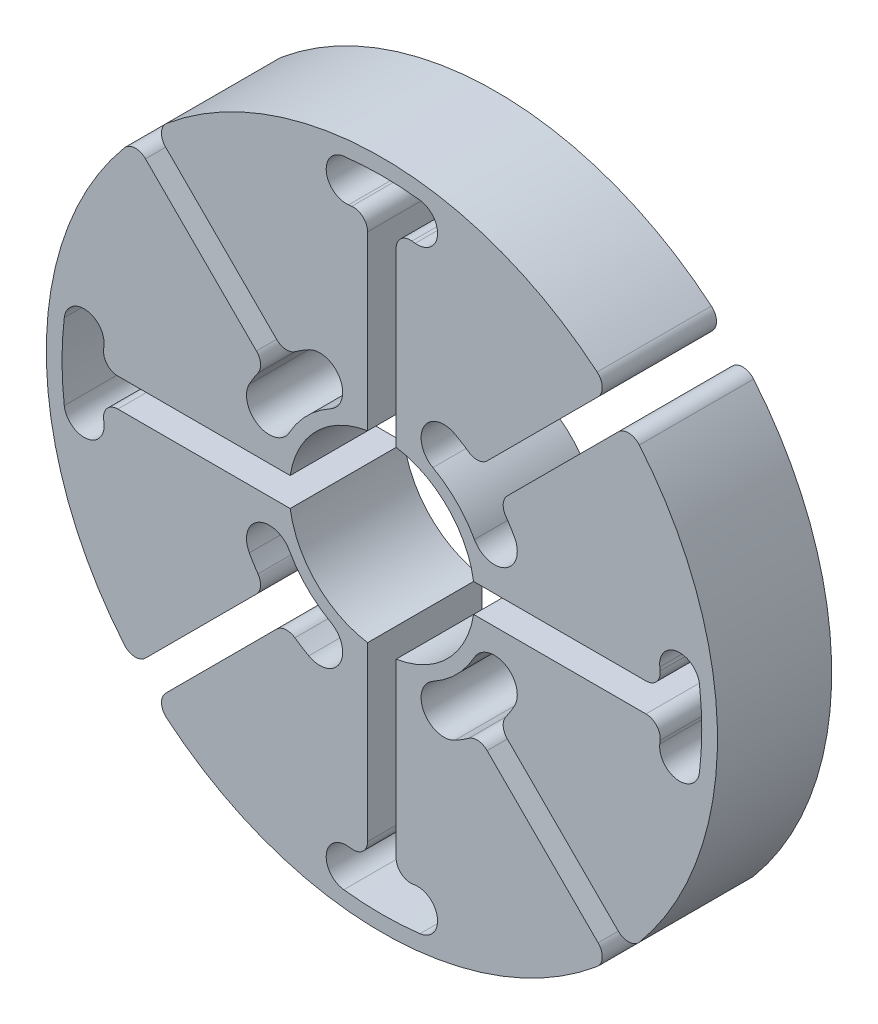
from build123d import *

# Parameters (mm, degrees)
SKETCH1_R                = 29.845
SKETCH1_R_2              = 8.255
BOSS_EXTRUDE1_DEPTH      = 5.08
CUT_EXTRUDE1_DEPTH       = 44.412828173
CUT_EXTRUDE2_DEPTH       = 44.412828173
FILLET1_R                = 1.27
CIRPATTERN1_COUNT        = 4
FILLET1_OF_CIRPATTERN1_R = 1.27


with BuildPart() as part:
    # Sketch1 → Boss-Extrude1 (new, symmetric)
    with BuildSketch(Plane.XY):
        Circle(SKETCH1_R)
        Circle(SKETCH1_R_2, mode=Mode.SUBTRACT)
    extrude(amount=BOSS_EXTRUDE1_DEPTH, both=True)

    # Sketch2 → Cut-Extrude1 (cut, through all)
    with BuildSketch(Plane.XY.offset(5.08)):
        with BuildLine():
            ThreePointArc((1.27, 24.85958093), (0, 24.892), (-1.27, 24.85958093))
            Line((-1.27, 24.85958093), (-1.27, 8.156722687))
            ThreePointArc((-1.27, 8.156722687), (0, 8.255), (1.27, 8.156722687))
            Line((1.27, 8.156722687), (1.27, 24.85958093))
        make_face()
        with BuildLine():
            ThreePointArc((3.386666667, 28.245693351), (0, 28.448), (-3.386666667, 28.245693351))
            ThreePointArc((-3.386666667, 28.245693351), (-4.940355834, 26.26867085), (-2.963333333, 24.714981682))
            ThreePointArc((-2.963333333, 24.714981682), (0, 24.892), (2.963333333, 24.714981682))
            ThreePointArc((2.963333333, 24.714981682), (4.940355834, 26.26867085), (3.386666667, 28.245693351))
        make_face()
    cut_extrude1 = extrude(amount=-CUT_EXTRUDE1_DEPTH, mode=Mode.SUBTRACT)

    # Sketch4 → Cut-Extrude2 (cut, through all)
    with BuildSketch(Plane.XY.offset(5.08)):
        with BuildLine():
            Line((-21.982511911, 20.186460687), (-10.37464273, 8.578591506))
            ThreePointArc((-10.37464273, 8.578591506), (-9.519071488, 9.519071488), (-8.578591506, 10.37464273))
            Line((-8.578591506, 10.37464273), (-20.186460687, 21.982511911))
            ThreePointArc((-20.186460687, 21.982511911), (-21.103601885, 21.103601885), (-21.982511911, 20.186460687))
        make_face()
        with BuildLine():
            ThreePointArc((-6.500265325, 11.788638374), (-9.519071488, 9.519071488), (-11.788638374, 6.500265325))
            ThreePointArc((-11.788638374, 6.500265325), (-10.990393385, 3.739676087), (-8.229804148, 4.537921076))
            ThreePointArc((-8.229804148, 4.537921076), (-6.64538953, 6.64538953), (-4.537921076, 8.229804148))
            ThreePointArc((-4.537921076, 8.229804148), (-3.739676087, 10.990393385), (-6.500265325, 11.788638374))
        make_face()
    cut_extrude2 = extrude(amount=-CUT_EXTRUDE2_DEPTH, mode=Mode.SUBTRACT)

    # Fillet1
    fillet1_edges = [part.edges().sort_by_distance(p)[0] for p in [
        (1.27, 24.85958093, 0),
        (-1.27, 24.85958093, 0),
        (-10.37464273, 8.578591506, 0),
        (-21.982511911, 20.186460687, 0),
        (-20.186460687, 21.982511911, 0),
        (-8.578591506, 10.37464273, 0),
    ]]
    fillet(fillet1_edges, radius=FILLET1_R)

    # CirPattern1: Cut-Extrude1, Cut-Extrude2 ×4 about axis
    cirpattern1_axis = Axis((0, 0, 0), (0, 0, 1))
    add([cut_extrude1.rotate(cirpattern1_axis, i * 360 / CIRPATTERN1_COUNT) for i in range(1, CIRPATTERN1_COUNT)], mode=Mode.SUBTRACT)
    add([cut_extrude2.rotate(cirpattern1_axis, i * 360 / CIRPATTERN1_COUNT) for i in range(1, CIRPATTERN1_COUNT)], mode=Mode.SUBTRACT)

    # Fillet1 of CirPattern1
    fillet1_of_cirpattern1_edges = [part.edges().sort_by_distance(p)[0] for p in [
        (-24.85958093, 1.27, 0),
        (-24.85958093, -1.27, 0),
        (-8.578591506, -10.37464273, 0),
        (-20.186460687, -21.982511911, 0),
        (-21.982511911, -20.186460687, 0),
        (-10.37464273, -8.578591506, 0),
        (-1.27, -24.85958093, 0),
        (1.27, -24.85958093, 0),
        (10.37464273, -8.578591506, 0),
        (21.982511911, -20.186460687, 0),
        (20.186460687, -21.982511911, 0),
        (8.578591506, -10.37464273, 0),
        (24.85958093, -1.27, 0),
        (24.85958093, 1.27, 0),
        (8.578591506, 10.37464273, 0),
        (20.186460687, 21.982511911, 0),
        (21.982511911, 20.186460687, 0),
        (10.37464273, 8.578591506, 0),
    ]]
    fillet(fillet1_of_cirpattern1_edges, radius=FILLET1_OF_CIRPATTERN1_R)


solid = part.part
